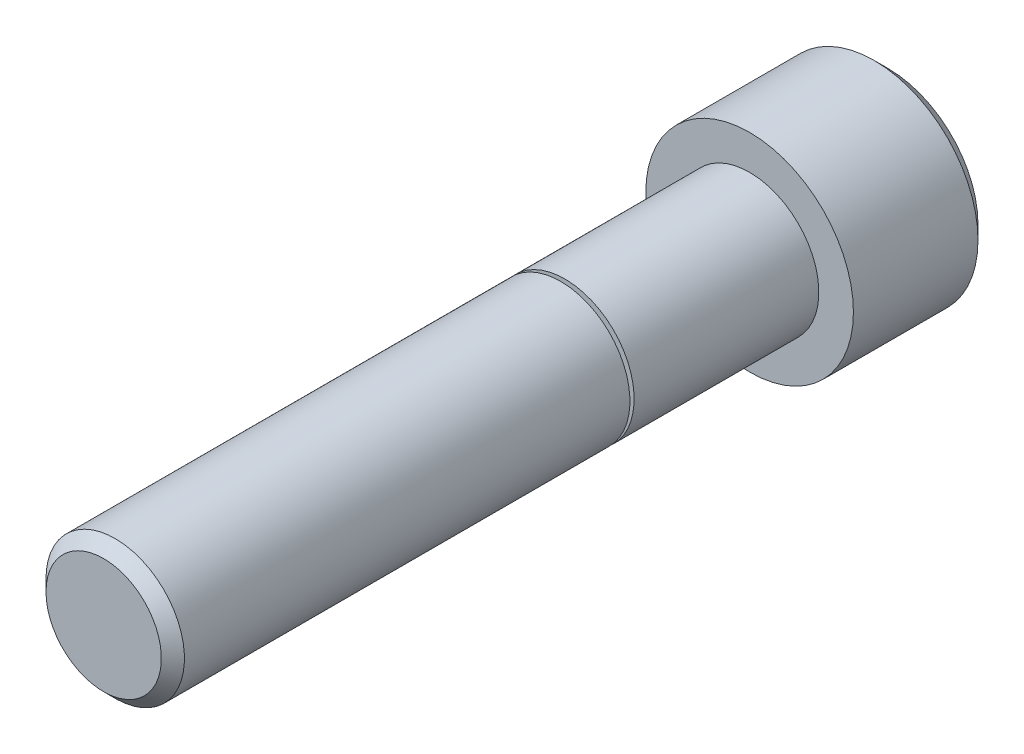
ISO-10303-21;
HEADER;
FILE_DESCRIPTION(('STEP AP214'),'2;1');
FILE_NAME('part.step','',(''),(''),'','','');
FILE_SCHEMA(('AUTOMOTIVE_DESIGN { 1 0 10303 214 1 1 1 1 }'));
ENDSEC;
DATA;
#1=APPLICATION_CONTEXT('core data for automotive mechanical design processes');
#2=APPLICATION_PROTOCOL_DEFINITION('international standard','automotive_design',2000,#1);
#3=PRODUCT_CONTEXT('',#1,'mechanical');
#4=PRODUCT('Part','Part','',(#3));
#5=PRODUCT_RELATED_PRODUCT_CATEGORY('part','',(#4));
#6=PRODUCT_DEFINITION_FORMATION('','',#4);
#7=PRODUCT_DEFINITION_CONTEXT('part definition',#1,'design');
#8=PRODUCT_DEFINITION('design','',#6,#7);
#9=PRODUCT_DEFINITION_SHAPE('','',#8);
#10=(LENGTH_UNIT() NAMED_UNIT(*) SI_UNIT(.MILLI.,.METRE.));
#11=(NAMED_UNIT(*) PLANE_ANGLE_UNIT() SI_UNIT($,.RADIAN.));
#12=(NAMED_UNIT(*) SI_UNIT($,.STERADIAN.) SOLID_ANGLE_UNIT());
#13=UNCERTAINTY_MEASURE_WITH_UNIT(LENGTH_MEASURE(1.E-05),#10,'distance_accuracy_value','');
#14=(GEOMETRIC_REPRESENTATION_CONTEXT(3) GLOBAL_UNCERTAINTY_ASSIGNED_CONTEXT((#13)) GLOBAL_UNIT_ASSIGNED_CONTEXT((#10,
#11,#12)) REPRESENTATION_CONTEXT('',''));
#15=CARTESIAN_POINT('',(0.,0.,0.));
#16=DIRECTION('',(0.,0.,1.));
#17=DIRECTION('',(1.,0.,0.));
#18=AXIS2_PLACEMENT_3D('',#15,#16,#17);
#19=CARTESIAN_POINT('',(0.,0.,-9.525));
#20=DIRECTION('',(0.,0.,1.));
#21=DIRECTION('',(1.,0.,0.));
#22=AXIS2_PLACEMENT_3D('',#19,#20,#21);
#23=PLANE('',#22);
#24=DIRECTION('',(-0.5,-0.866025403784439,0.));
#25=VECTOR('',#24,1.);
#26=CARTESIAN_POINT('',(4.57538541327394,0.,-9.525));
#27=LINE('',#26,#25);
#28=CARTESIAN_POINT('',(4.57538541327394,0.,-9.525));
#29=VERTEX_POINT('',#28);
#30=CARTESIAN_POINT('',(2.28769270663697,-3.96240000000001,-9.525));
#31=VERTEX_POINT('',#30);
#32=EDGE_CURVE('E145',#29,#31,#27,.T.);
#33=ORIENTED_EDGE('',*,*,#32,.F.);
#34=DIRECTION('',(0.499999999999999,-0.866025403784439,0.));
#35=VECTOR('',#34,1.);
#36=CARTESIAN_POINT('',(2.28769270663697,3.9624,-9.525));
#37=LINE('',#36,#35);
#38=CARTESIAN_POINT('',(2.28769270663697,3.9624,-9.525));
#39=VERTEX_POINT('',#38);
#40=EDGE_CURVE('E64',#39,#29,#37,.T.);
#41=ORIENTED_EDGE('',*,*,#40,.F.);
#42=DIRECTION('',(1.,0.,0.));
#43=VECTOR('',#42,1.);
#44=CARTESIAN_POINT('',(-2.28769270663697,3.9624,-9.525));
#45=LINE('',#44,#43);
#46=CARTESIAN_POINT('',(-2.28769270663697,3.9624,-9.525));
#47=VERTEX_POINT('',#46);
#48=EDGE_CURVE('E158',#47,#39,#45,.T.);
#49=ORIENTED_EDGE('',*,*,#48,.F.);
#50=DIRECTION('',(0.5,0.866025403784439,0.));
#51=VECTOR('',#50,1.);
#52=CARTESIAN_POINT('',(-4.57538541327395,0.,-9.525));
#53=LINE('',#52,#51);
#54=CARTESIAN_POINT('',(-4.57538541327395,0.,-9.525));
#55=VERTEX_POINT('',#54);
#56=EDGE_CURVE('E155',#55,#47,#53,.T.);
#57=ORIENTED_EDGE('',*,*,#56,.F.);
#58=DIRECTION('',(-0.5,0.866025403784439,0.));
#59=VECTOR('',#58,1.);
#60=CARTESIAN_POINT('',(-2.28769270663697,-3.96240000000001,-9.525));
#61=LINE('',#60,#59);
#62=CARTESIAN_POINT('',(-2.28769270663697,-3.96240000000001,-9.525));
#63=VERTEX_POINT('',#62);
#64=EDGE_CURVE('E112',#63,#55,#61,.T.);
#65=ORIENTED_EDGE('',*,*,#64,.F.);
#66=DIRECTION('',(-1.,0.,0.));
#67=VECTOR('',#66,1.);
#68=CARTESIAN_POINT('',(2.28769270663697,-3.96240000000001,-9.525));
#69=LINE('',#68,#67);
#70=EDGE_CURVE('E149',#31,#63,#69,.T.);
#71=ORIENTED_EDGE('',*,*,#70,.F.);
#72=EDGE_LOOP('',(#33,#41,#49,#57,#65,#71));
#73=FACE_BOUND('',#72,.T.);
#74=CARTESIAN_POINT('',(0.,0.,-9.525));
#75=DIRECTION('',(0.,0.,-1.));
#76=DIRECTION('',(-1.,0.,0.));
#77=AXIS2_PLACEMENT_3D('',#74,#75,#76);
#78=CIRCLE('',#77,6.19125000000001);
#79=CARTESIAN_POINT('',(-6.19125000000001,0.,-9.525));
#80=VERTEX_POINT('',#79);
#81=EDGE_CURVE('E164',#80,#80,#78,.T.);
#82=ORIENTED_EDGE('',*,*,#81,.T.);
#83=EDGE_LOOP('',(#82));
#84=FACE_BOUND('',#83,.T.);
#85=ADVANCED_FACE('F49',(#73,#84),#23,.F.);
#86=CARTESIAN_POINT('',(-3.96875000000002,0.,44.45));
#87=DIRECTION('',(0.,0.,-1.));
#88=DIRECTION('',(-1.,0.,0.));
#89=AXIS2_PLACEMENT_3D('',#86,#87,#88);
#90=PLANE('',#89);
#91=CARTESIAN_POINT('',(0.,0.,44.45));
#92=DIRECTION('',(0.,0.,-1.));
#93=DIRECTION('',(-1.,0.,0.));
#94=AXIS2_PLACEMENT_3D('',#91,#92,#93);
#95=CIRCLE('',#94,3.96875000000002);
#96=CARTESIAN_POINT('',(-3.96875000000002,0.,44.45));
#97=VERTEX_POINT('',#96);
#98=EDGE_CURVE('E11',#97,#97,#95,.T.);
#99=ORIENTED_EDGE('',*,*,#98,.F.);
#100=EDGE_LOOP('',(#99));
#101=FACE_BOUND('',#100,.T.);
#102=ADVANCED_FACE('F214',(#101),#90,.F.);
#103=CARTESIAN_POINT('',(0.,0.,44.45));
#104=DIRECTION('',(0.,0.,-1.));
#105=DIRECTION('',(-1.,0.,0.));
#106=AXIS2_PLACEMENT_3D('',#103,#104,#105);
#107=CONICAL_SURFACE('',#106,3.96875000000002,0.78539816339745);
#108=CARTESIAN_POINT('',(0.,0.,43.65625));
#109=DIRECTION('',(0.,0.,-1.));
#110=DIRECTION('',(-1.,0.,0.));
#111=AXIS2_PLACEMENT_3D('',#108,#109,#110);
#112=CIRCLE('',#111,4.76250000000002);
#113=CARTESIAN_POINT('',(-4.76250000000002,0.,43.65625));
#114=VERTEX_POINT('',#113);
#115=EDGE_CURVE('E57',#114,#114,#112,.T.);
#116=ORIENTED_EDGE('',*,*,#115,.F.);
#117=EDGE_LOOP('',(#116));
#118=FACE_BOUND('',#117,.T.);
#119=ORIENTED_EDGE('',*,*,#98,.T.);
#120=EDGE_LOOP('',(#119));
#121=FACE_BOUND('',#120,.T.);
#122=ADVANCED_FACE('F211',(#118,#121),#107,.T.);
#123=CARTESIAN_POINT('',(0.,0.,-10.585154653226));
#124=DIRECTION('',(0.,0.,-1.));
#125=DIRECTION('',(-1.,0.,0.));
#126=AXIS2_PLACEMENT_3D('',#123,#124,#125);
#127=CYLINDRICAL_SURFACE('',#126,4.76250000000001);
#128=CARTESIAN_POINT('',(0.,0.,12.9989013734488));
#129=DIRECTION('',(0.,0.,-1.));
#130=DIRECTION('',(-1.,0.,0.));
#131=AXIS2_PLACEMENT_3D('',#128,#129,#130);
#132=CIRCLE('',#131,4.76250000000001);
#133=CARTESIAN_POINT('',(-4.76250000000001,0.,12.9989013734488));
#134=VERTEX_POINT('',#133);
#135=EDGE_CURVE('E201',#134,#134,#132,.T.);
#136=ORIENTED_EDGE('',*,*,#135,.F.);
#137=EDGE_LOOP('',(#136));
#138=FACE_BOUND('',#137,.T.);
#139=ORIENTED_EDGE('',*,*,#115,.T.);
#140=EDGE_LOOP('',(#139));
#141=FACE_BOUND('',#140,.T.);
#142=ADVANCED_FACE('F209',(#138,#141),#127,.T.);
#143=CARTESIAN_POINT('',(0.,0.,12.9989013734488));
#144=DIRECTION('',(0.,0.,1.));
#145=DIRECTION('',(1.,0.,0.));
#146=AXIS2_PLACEMENT_3D('',#143,#144,#145);
#147=CONICAL_SURFACE('',#146,4.76250000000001,1.22173047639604);
#148=CARTESIAN_POINT('',(0.,0.,12.7487938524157));
#149=DIRECTION('',(0.,0.,-1.));
#150=DIRECTION('',(-1.,0.,0.));
#151=AXIS2_PLACEMENT_3D('',#148,#149,#150);
#152=CIRCLE('',#151,4.07533523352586);
#153=CARTESIAN_POINT('',(-4.07533523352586,0.,12.7487938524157));
#154=VERTEX_POINT('',#153);
#155=EDGE_CURVE('E197',#154,#154,#152,.T.);
#156=ORIENTED_EDGE('',*,*,#155,.F.);
#157=EDGE_LOOP('',(#156));
#158=FACE_BOUND('',#157,.T.);
#159=ORIENTED_EDGE('',*,*,#135,.T.);
#160=EDGE_LOOP('',(#159));
#161=FACE_BOUND('',#160,.T.);
#162=ADVANCED_FACE('F226',(#158,#161),#147,.T.);
#163=CARTESIAN_POINT('',(0.,0.,12.73));
#164=DIRECTION('',(0.,0.,-1.));
#165=DIRECTION('',(-1.,0.,0.));
#166=AXIS2_PLACEMENT_3D('',#163,#164,#165);
#167=TOROIDAL_SURFACE('',#166,4.08217563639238,0.0199999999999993);
#168=CARTESIAN_POINT('',(0.,0.,12.71));
#169=DIRECTION('',(0.,0.,-1.));
#170=DIRECTION('',(-1.,0.,0.));
#171=AXIS2_PLACEMENT_3D('',#168,#169,#170);
#172=CIRCLE('',#171,4.08217563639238);
#173=CARTESIAN_POINT('',(-4.08217563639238,0.,12.71));
#174=VERTEX_POINT('',#173);
#175=EDGE_CURVE('E193',#174,#174,#172,.T.);
#176=ORIENTED_EDGE('',*,*,#175,.F.);
#177=EDGE_LOOP('',(#176));
#178=FACE_BOUND('',#177,.T.);
#179=ORIENTED_EDGE('',*,*,#155,.T.);
#180=EDGE_LOOP('',(#179));
#181=FACE_BOUND('',#180,.T.);
#182=ADVANCED_FACE('F230',(#178,#181),#167,.F.);
#183=CARTESIAN_POINT('',(-4.76250000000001,0.,12.71));
#184=DIRECTION('',(0.,0.,-1.));
#185=DIRECTION('',(-1.,0.,0.));
#186=AXIS2_PLACEMENT_3D('',#183,#184,#185);
#187=PLANE('',#186);
#188=CARTESIAN_POINT('',(0.,0.,12.71));
#189=DIRECTION('',(0.,0.,-1.));
#190=DIRECTION('',(-1.,0.,0.));
#191=AXIS2_PLACEMENT_3D('',#188,#189,#190);
#192=CIRCLE('',#191,4.76250000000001);
#193=CARTESIAN_POINT('',(-4.76250000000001,0.,12.71));
#194=VERTEX_POINT('',#193);
#195=EDGE_CURVE('E189',#194,#194,#192,.T.);
#196=ORIENTED_EDGE('',*,*,#195,.F.);
#197=EDGE_LOOP('',(#196));
#198=FACE_BOUND('',#197,.T.);
#199=ORIENTED_EDGE('',*,*,#175,.T.);
#200=EDGE_LOOP('',(#199));
#201=FACE_BOUND('',#200,.T.);
#202=ADVANCED_FACE('F234',(#198,#201),#187,.F.);
#203=CARTESIAN_POINT('',(0.,0.,-10.585154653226));
#204=DIRECTION('',(0.,0.,-1.));
#205=DIRECTION('',(-1.,0.,0.));
#206=AXIS2_PLACEMENT_3D('',#203,#204,#205);
#207=CYLINDRICAL_SURFACE('',#206,4.7625);
#208=CARTESIAN_POINT('',(0.,0.,0.));
#209=DIRECTION('',(0.,0.,-1.));
#210=DIRECTION('',(-1.,0.,0.));
#211=AXIS2_PLACEMENT_3D('',#208,#209,#210);
#212=CIRCLE('',#211,4.7625);
#213=CARTESIAN_POINT('',(-4.7625,0.,0.));
#214=VERTEX_POINT('',#213);
#215=EDGE_CURVE('E185',#214,#214,#212,.T.);
#216=ORIENTED_EDGE('',*,*,#215,.F.);
#217=EDGE_LOOP('',(#216));
#218=FACE_BOUND('',#217,.T.);
#219=ORIENTED_EDGE('',*,*,#195,.T.);
#220=EDGE_LOOP('',(#219));
#221=FACE_BOUND('',#220,.T.);
#222=ADVANCED_FACE('F238',(#218,#221),#207,.T.);
#223=CARTESIAN_POINT('',(-7.14375000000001,0.,0.));
#224=DIRECTION('',(0.,0.,-1.));
#225=DIRECTION('',(-1.,0.,0.));
#226=AXIS2_PLACEMENT_3D('',#223,#224,#225);
#227=PLANE('',#226);
#228=CARTESIAN_POINT('',(0.,0.,0.));
#229=DIRECTION('',(0.,0.,-1.));
#230=DIRECTION('',(-1.,0.,0.));
#231=AXIS2_PLACEMENT_3D('',#228,#229,#230);
#232=CIRCLE('',#231,7.14375000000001);
#233=CARTESIAN_POINT('',(-7.14375000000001,0.,0.));
#234=VERTEX_POINT('',#233);
#235=EDGE_CURVE('E181',#234,#234,#232,.T.);
#236=ORIENTED_EDGE('',*,*,#235,.F.);
#237=EDGE_LOOP('',(#236));
#238=FACE_BOUND('',#237,.T.);
#239=ORIENTED_EDGE('',*,*,#215,.T.);
#240=EDGE_LOOP('',(#239));
#241=FACE_BOUND('',#240,.T.);
#242=ADVANCED_FACE('F242',(#238,#241),#227,.F.);
#243=CARTESIAN_POINT('',(0.,0.,-10.585154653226));
#244=DIRECTION('',(0.,0.,-1.));
#245=DIRECTION('',(-1.,0.,0.));
#246=AXIS2_PLACEMENT_3D('',#243,#244,#245);
#247=CYLINDRICAL_SURFACE('',#246,7.14375);
#248=CARTESIAN_POINT('',(0.,0.,-8.57249999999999));
#249=DIRECTION('',(0.,0.,-1.));
#250=DIRECTION('',(-1.,0.,0.));
#251=AXIS2_PLACEMENT_3D('',#248,#249,#250);
#252=CIRCLE('',#251,7.14375);
#253=CARTESIAN_POINT('',(-7.14375,0.,-8.57249999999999));
#254=VERTEX_POINT('',#253);
#255=EDGE_CURVE('E177',#254,#254,#252,.T.);
#256=ORIENTED_EDGE('',*,*,#255,.F.);
#257=EDGE_LOOP('',(#256));
#258=FACE_BOUND('',#257,.T.);
#259=ORIENTED_EDGE('',*,*,#235,.T.);
#260=EDGE_LOOP('',(#259));
#261=FACE_BOUND('',#260,.T.);
#262=ADVANCED_FACE('F246',(#258,#261),#247,.T.);
#263=CARTESIAN_POINT('',(0.,0.,-8.57249999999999));
#264=DIRECTION('',(0.,0.,1.));
#265=DIRECTION('',(1.,0.,0.));
#266=AXIS2_PLACEMENT_3D('',#263,#264,#265);
#267=CONICAL_SURFACE('',#266,7.14375,0.785398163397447);
#268=ORIENTED_EDGE('',*,*,#81,.F.);
#269=EDGE_LOOP('',(#268));
#270=FACE_BOUND('',#269,.T.);
#271=ORIENTED_EDGE('',*,*,#255,.T.);
#272=EDGE_LOOP('',(#271));
#273=FACE_BOUND('',#272,.T.);
#274=ADVANCED_FACE('F250',(#270,#273),#267,.T.);
#275=CARTESIAN_POINT('',(2.28769270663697,3.9624,-4.76249999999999));
#276=DIRECTION('',(0.866025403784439,0.499999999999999,0.));
#277=DIRECTION('',(-0.499999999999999,0.866025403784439,0.));
#278=AXIS2_PLACEMENT_3D('',#275,#276,#277);
#279=PLANE('',#278);
#280=ORIENTED_EDGE('',*,*,#40,.T.);
#281=DIRECTION('',(0.,0.,-1.));
#282=VECTOR('',#281,1.);
#283=CARTESIAN_POINT('',(4.57538541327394,0.,-4.76249999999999));
#284=LINE('',#283,#282);
#285=CARTESIAN_POINT('',(4.57538541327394,0.,-4.76249999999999));
#286=VERTEX_POINT('',#285);
#287=EDGE_CURVE('E94',#286,#29,#284,.T.);
#288=ORIENTED_EDGE('',*,*,#287,.F.);
#289=DIRECTION('',(0.499999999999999,-0.866025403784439,0.));
#290=VECTOR('',#289,1.);
#291=CARTESIAN_POINT('',(2.28769270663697,3.9624,-4.76249999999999));
#292=LINE('',#291,#290);
#293=CARTESIAN_POINT('',(2.28769270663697,3.9624,-4.76249999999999));
#294=VERTEX_POINT('',#293);
#295=EDGE_CURVE('E161',#294,#286,#292,.T.);
#296=ORIENTED_EDGE('',*,*,#295,.F.);
#297=DIRECTION('',(0.,0.,-1.));
#298=VECTOR('',#297,1.);
#299=CARTESIAN_POINT('',(2.28769270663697,3.9624,-4.76249999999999));
#300=LINE('',#299,#298);
#301=EDGE_CURVE('E72',#294,#39,#300,.T.);
#302=ORIENTED_EDGE('',*,*,#301,.T.);
#303=EDGE_LOOP('',(#280,#288,#296,#302));
#304=FACE_BOUND('',#303,.T.);
#305=ADVANCED_FACE('F254',(#304),#279,.F.);
#306=CARTESIAN_POINT('',(-2.28769270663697,3.9624,-4.76249999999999));
#307=DIRECTION('',(0.,1.,0.));
#308=DIRECTION('',(-1.,0.,0.));
#309=AXIS2_PLACEMENT_3D('',#306,#307,#308);
#310=PLANE('',#309);
#311=ORIENTED_EDGE('',*,*,#48,.T.);
#312=ORIENTED_EDGE('',*,*,#301,.F.);
#313=DIRECTION('',(1.,0.,0.));
#314=VECTOR('',#313,1.);
#315=CARTESIAN_POINT('',(-2.28769270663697,3.9624,-4.76249999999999));
#316=LINE('',#315,#314);
#317=CARTESIAN_POINT('',(-2.28769270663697,3.9624,-4.76249999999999));
#318=VERTEX_POINT('',#317);
#319=EDGE_CURVE('E126',#318,#294,#316,.T.);
#320=ORIENTED_EDGE('',*,*,#319,.F.);
#321=DIRECTION('',(0.,0.,-1.));
#322=VECTOR('',#321,1.);
#323=CARTESIAN_POINT('',(-2.28769270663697,3.9624,-4.76249999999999));
#324=LINE('',#323,#322);
#325=EDGE_CURVE('E117',#318,#47,#324,.T.);
#326=ORIENTED_EDGE('',*,*,#325,.T.);
#327=EDGE_LOOP('',(#311,#312,#320,#326));
#328=FACE_BOUND('',#327,.T.);
#329=ADVANCED_FACE('F258',(#328),#310,.F.);
#330=CARTESIAN_POINT('',(-4.57538541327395,0.,-4.76249999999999));
#331=DIRECTION('',(-0.866025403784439,0.5,0.));
#332=DIRECTION('',(-0.5,-0.866025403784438,0.));
#333=AXIS2_PLACEMENT_3D('',#330,#331,#332);
#334=PLANE('',#333);
#335=ORIENTED_EDGE('',*,*,#56,.T.);
#336=ORIENTED_EDGE('',*,*,#325,.F.);
#337=DIRECTION('',(0.5,0.866025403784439,0.));
#338=VECTOR('',#337,1.);
#339=CARTESIAN_POINT('',(-4.57538541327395,0.,-4.76249999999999));
#340=LINE('',#339,#338);
#341=CARTESIAN_POINT('',(-4.57538541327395,0.,-4.76249999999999));
#342=VERTEX_POINT('',#341);
#343=EDGE_CURVE('E121',#342,#318,#340,.T.);
#344=ORIENTED_EDGE('',*,*,#343,.F.);
#345=DIRECTION('',(0.,0.,-1.));
#346=VECTOR('',#345,1.);
#347=CARTESIAN_POINT('',(-4.57538541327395,0.,-4.76249999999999));
#348=LINE('',#347,#346);
#349=EDGE_CURVE('E105',#342,#55,#348,.T.);
#350=ORIENTED_EDGE('',*,*,#349,.T.);
#351=EDGE_LOOP('',(#335,#336,#344,#350));
#352=FACE_BOUND('',#351,.T.);
#353=ADVANCED_FACE('F122',(#352),#334,.F.);
#354=CARTESIAN_POINT('',(-2.28769270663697,-3.9624,-4.76249999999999));
#355=DIRECTION('',(-0.866025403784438,-0.5,0.));
#356=DIRECTION('',(0.5,-0.866025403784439,0.));
#357=AXIS2_PLACEMENT_3D('',#354,#355,#356);
#358=PLANE('',#357);
#359=ORIENTED_EDGE('',*,*,#64,.T.);
#360=ORIENTED_EDGE('',*,*,#349,.F.);
#361=DIRECTION('',(-0.5,0.866025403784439,0.));
#362=VECTOR('',#361,1.);
#363=CARTESIAN_POINT('',(-2.28769270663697,-3.9624,-4.76249999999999));
#364=LINE('',#363,#362);
#365=CARTESIAN_POINT('',(-2.28769270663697,-3.9624,-4.76249999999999));
#366=VERTEX_POINT('',#365);
#367=EDGE_CURVE('E109',#366,#342,#364,.T.);
#368=ORIENTED_EDGE('',*,*,#367,.F.);
#369=DIRECTION('',(0.,0.,-1.));
#370=VECTOR('',#369,1.);
#371=CARTESIAN_POINT('',(-2.28769270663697,-3.9624,-4.76249999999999));
#372=LINE('',#371,#370);
#373=EDGE_CURVE('E118',#366,#63,#372,.T.);
#374=ORIENTED_EDGE('',*,*,#373,.T.);
#375=EDGE_LOOP('',(#359,#360,#368,#374));
#376=FACE_BOUND('',#375,.T.);
#377=ADVANCED_FACE('F107',(#376),#358,.F.);
#378=CARTESIAN_POINT('',(2.28769270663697,-3.9624,-4.76249999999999));
#379=DIRECTION('',(0.,-1.,0.));
#380=DIRECTION('',(0.,0.,-1.));
#381=AXIS2_PLACEMENT_3D('',#378,#379,#380);
#382=PLANE('',#381);
#383=ORIENTED_EDGE('',*,*,#70,.T.);
#384=ORIENTED_EDGE('',*,*,#373,.F.);
#385=DIRECTION('',(-1.,0.,0.));
#386=VECTOR('',#385,1.);
#387=CARTESIAN_POINT('',(2.28769270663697,-3.9624,-4.76249999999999));
#388=LINE('',#387,#386);
#389=CARTESIAN_POINT('',(2.28769270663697,-3.9624,-4.76249999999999));
#390=VERTEX_POINT('',#389);
#391=EDGE_CURVE('E132',#390,#366,#388,.T.);
#392=ORIENTED_EDGE('',*,*,#391,.F.);
#393=DIRECTION('',(0.,0.,-1.));
#394=VECTOR('',#393,1.);
#395=CARTESIAN_POINT('',(2.28769270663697,-3.9624,-4.76249999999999));
#396=LINE('',#395,#394);
#397=EDGE_CURVE('E169',#390,#31,#396,.T.);
#398=ORIENTED_EDGE('',*,*,#397,.T.);
#399=EDGE_LOOP('',(#383,#384,#392,#398));
#400=FACE_BOUND('',#399,.T.);
#401=ADVANCED_FACE('F262',(#400),#382,.F.);
#402=CARTESIAN_POINT('',(4.57538541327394,0.,-4.76249999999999));
#403=DIRECTION('',(0.866025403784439,-0.5,0.));
#404=DIRECTION('',(0.5,0.866025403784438,0.));
#405=AXIS2_PLACEMENT_3D('',#402,#403,#404);
#406=PLANE('',#405);
#407=ORIENTED_EDGE('',*,*,#32,.T.);
#408=ORIENTED_EDGE('',*,*,#397,.F.);
#409=DIRECTION('',(-0.5,-0.866025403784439,0.));
#410=VECTOR('',#409,1.);
#411=CARTESIAN_POINT('',(4.57538541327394,0.,-4.76249999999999));
#412=LINE('',#411,#410);
#413=EDGE_CURVE('E137',#286,#390,#412,.T.);
#414=ORIENTED_EDGE('',*,*,#413,.F.);
#415=ORIENTED_EDGE('',*,*,#287,.T.);
#416=EDGE_LOOP('',(#407,#408,#414,#415));
#417=FACE_BOUND('',#416,.T.);
#418=ADVANCED_FACE('F259',(#417),#406,.F.);
#419=CARTESIAN_POINT('',(2.28769270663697,3.9624,-4.76249999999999));
#420=DIRECTION('',(0.,0.,1.));
#421=DIRECTION('',(1.,0.,0.));
#422=AXIS2_PLACEMENT_3D('',#419,#420,#421);
#423=PLANE('',#422);
#424=ORIENTED_EDGE('',*,*,#295,.T.);
#425=ORIENTED_EDGE('',*,*,#413,.T.);
#426=ORIENTED_EDGE('',*,*,#391,.T.);
#427=ORIENTED_EDGE('',*,*,#367,.T.);
#428=ORIENTED_EDGE('',*,*,#343,.T.);
#429=ORIENTED_EDGE('',*,*,#319,.T.);
#430=EDGE_LOOP('',(#424,#425,#426,#427,#428,#429));
#431=FACE_BOUND('',#430,.T.);
#432=ADVANCED_FACE('F129',(#431),#423,.F.);
#433=CLOSED_SHELL('',(#85,#102,#122,#142,#162,#182,#202,#222,#242,#262,#274,#305,#329,#353,#377,
#401,#418,#432));
#434=MANIFOLD_SOLID_BREP('B2',#433);
#435=ADVANCED_BREP_SHAPE_REPRESENTATION('',(#18,#434),#14);
#436=SHAPE_DEFINITION_REPRESENTATION(#9,#435);
ENDSEC;
END-ISO-10303-21;
